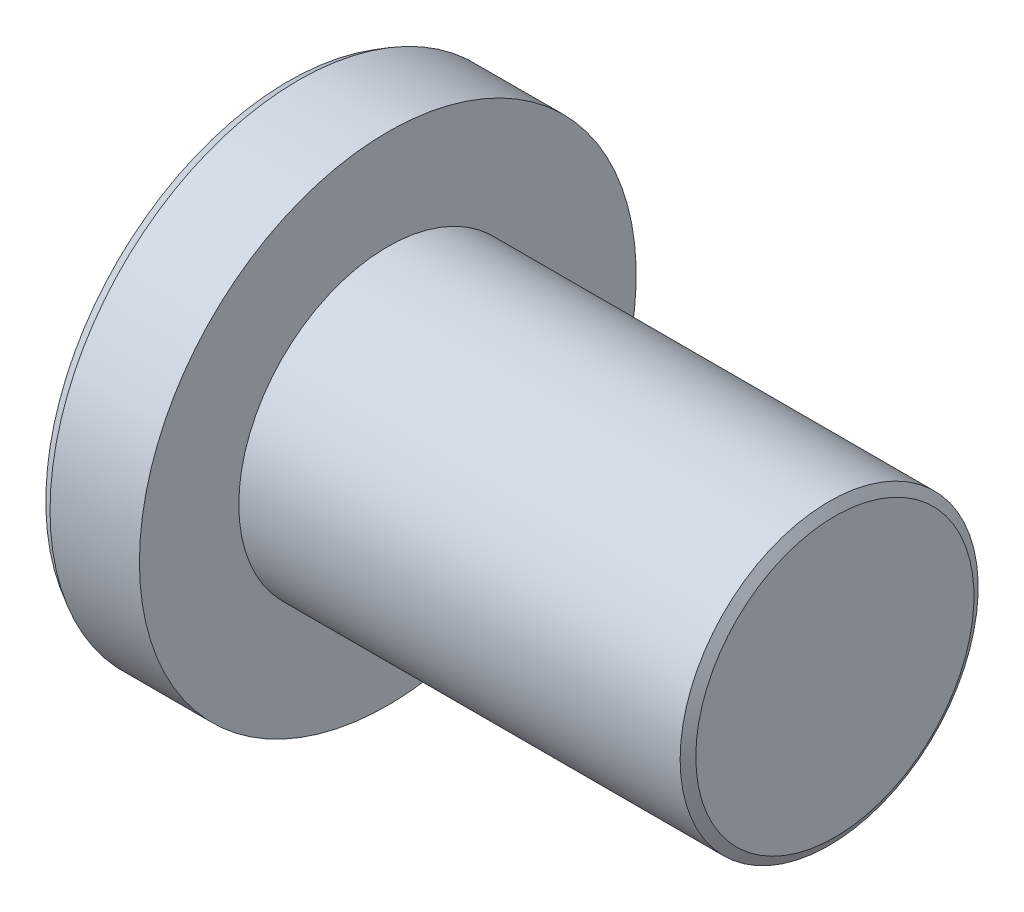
ISO-10303-21;
HEADER;
FILE_DESCRIPTION(('STEP AP214'),'2;1');
FILE_NAME('part.step','',(''),(''),'','','');
FILE_SCHEMA(('AUTOMOTIVE_DESIGN { 1 0 10303 214 1 1 1 1 }'));
ENDSEC;
DATA;
#1=APPLICATION_CONTEXT('core data for automotive mechanical design processes');
#2=APPLICATION_PROTOCOL_DEFINITION('international standard','automotive_design',2000,#1);
#3=PRODUCT_CONTEXT('',#1,'mechanical');
#4=PRODUCT('Part','Part','',(#3));
#5=PRODUCT_RELATED_PRODUCT_CATEGORY('part','',(#4));
#6=PRODUCT_DEFINITION_FORMATION('','',#4);
#7=PRODUCT_DEFINITION_CONTEXT('part definition',#1,'design');
#8=PRODUCT_DEFINITION('design','',#6,#7);
#9=PRODUCT_DEFINITION_SHAPE('','',#8);
#10=(LENGTH_UNIT() NAMED_UNIT(*) SI_UNIT(.MILLI.,.METRE.));
#11=(NAMED_UNIT(*) PLANE_ANGLE_UNIT() SI_UNIT($,.RADIAN.));
#12=(NAMED_UNIT(*) SI_UNIT($,.STERADIAN.) SOLID_ANGLE_UNIT());
#13=UNCERTAINTY_MEASURE_WITH_UNIT(LENGTH_MEASURE(1.E-05),#10,'distance_accuracy_value','');
#14=(GEOMETRIC_REPRESENTATION_CONTEXT(3) GLOBAL_UNCERTAINTY_ASSIGNED_CONTEXT((#13)) GLOBAL_UNIT_ASSIGNED_CONTEXT((#10,
#11,#12)) REPRESENTATION_CONTEXT('',''));
#15=CARTESIAN_POINT('',(0.,0.,0.));
#16=DIRECTION('',(0.,0.,1.));
#17=DIRECTION('',(1.,0.,0.));
#18=AXIS2_PLACEMENT_3D('',#15,#16,#17);
#19=CARTESIAN_POINT('',(55.,15.,0.));
#20=DIRECTION('',(-1.,0.,0.));
#21=DIRECTION('',(0.,0.,1.));
#22=AXIS2_PLACEMENT_3D('',#19,#20,#21);
#23=PLANE('',#22);
#24=CARTESIAN_POINT('',(55.,0.,0.));
#25=DIRECTION('',(-1.,0.,0.));
#26=DIRECTION('',(0.,0.,1.));
#27=AXIS2_PLACEMENT_3D('',#24,#25,#26);
#28=CIRCLE('',#27,14.);
#29=CARTESIAN_POINT('',(55.,0.,14.));
#30=VERTEX_POINT('',#29);
#31=EDGE_CURVE('E39',#30,#30,#28,.F.);
#32=ORIENTED_EDGE('',*,*,#31,.T.);
#33=EDGE_LOOP('',(#32));
#34=FACE_BOUND('',#33,.T.);
#35=ADVANCED_FACE('F29',(#34),#23,.F.);
#36=CARTESIAN_POINT('',(-45.6597764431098,0.,0.));
#37=DIRECTION('',(-1.,0.,0.));
#38=DIRECTION('',(0.,0.,1.));
#39=AXIS2_PLACEMENT_3D('',#36,#37,#38);
#40=CYLINDRICAL_SURFACE('',#39,15.);
#41=CARTESIAN_POINT('',(54.4226497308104,0.,0.));
#42=DIRECTION('',(-1.,0.,0.));
#43=DIRECTION('',(0.,0.,1.));
#44=AXIS2_PLACEMENT_3D('',#41,#42,#43);
#45=CIRCLE('',#44,15.);
#46=CARTESIAN_POINT('',(54.4226497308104,0.,15.));
#47=VERTEX_POINT('',#46);
#48=EDGE_CURVE('E43',#47,#47,#45,.T.);
#49=ORIENTED_EDGE('',*,*,#48,.T.);
#50=EDGE_LOOP('',(#49));
#51=FACE_BOUND('',#50,.T.);
#52=CARTESIAN_POINT('',(10.,0.,0.));
#53=DIRECTION('',(-1.,0.,0.));
#54=DIRECTION('',(0.,0.,1.));
#55=AXIS2_PLACEMENT_3D('',#52,#53,#54);
#56=CIRCLE('',#55,15.);
#57=CARTESIAN_POINT('',(10.,0.,15.));
#58=VERTEX_POINT('',#57);
#59=EDGE_CURVE('E48',#58,#58,#56,.T.);
#60=ORIENTED_EDGE('',*,*,#59,.F.);
#61=EDGE_LOOP('',(#60));
#62=FACE_BOUND('',#61,.T.);
#63=ADVANCED_FACE('F60',(#51,#62),#40,.T.);
#64=CARTESIAN_POINT('',(10.,25.,0.));
#65=DIRECTION('',(-1.,0.,0.));
#66=DIRECTION('',(0.,0.,1.));
#67=AXIS2_PLACEMENT_3D('',#64,#65,#66);
#68=PLANE('',#67);
#69=CARTESIAN_POINT('',(10.,0.,0.));
#70=DIRECTION('',(-1.,0.,0.));
#71=DIRECTION('',(0.,0.,1.));
#72=AXIS2_PLACEMENT_3D('',#69,#70,#71);
#73=CIRCLE('',#72,25.);
#74=CARTESIAN_POINT('',(10.,0.,25.));
#75=VERTEX_POINT('',#74);
#76=EDGE_CURVE('E51',#75,#75,#73,.T.);
#77=ORIENTED_EDGE('',*,*,#76,.F.);
#78=EDGE_LOOP('',(#77));
#79=FACE_BOUND('',#78,.T.);
#80=ORIENTED_EDGE('',*,*,#59,.T.);
#81=EDGE_LOOP('',(#80));
#82=FACE_BOUND('',#81,.T.);
#83=ADVANCED_FACE('F57',(#79,#82),#68,.F.);
#84=CARTESIAN_POINT('',(-45.6597764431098,0.,0.));
#85=DIRECTION('',(-1.,0.,0.));
#86=DIRECTION('',(0.,0.,1.));
#87=AXIS2_PLACEMENT_3D('',#84,#85,#86);
#88=CYLINDRICAL_SURFACE('',#87,25.);
#89=CARTESIAN_POINT('',(0.999999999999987,0.,0.));
#90=DIRECTION('',(1.,0.,0.));
#91=DIRECTION('',(0.,0.,-1.));
#92=AXIS2_PLACEMENT_3D('',#89,#90,#91);
#93=CIRCLE('',#92,25.);
#94=CARTESIAN_POINT('',(0.999999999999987,0.,-25.));
#95=VERTEX_POINT('',#94);
#96=EDGE_CURVE('E10',#95,#95,#93,.T.);
#97=ORIENTED_EDGE('',*,*,#96,.T.);
#98=EDGE_LOOP('',(#97));
#99=FACE_BOUND('',#98,.T.);
#100=ORIENTED_EDGE('',*,*,#76,.T.);
#101=EDGE_LOOP('',(#100));
#102=FACE_BOUND('',#101,.T.);
#103=ADVANCED_FACE('F55',(#99,#102),#88,.T.);
#104=CARTESIAN_POINT('',(0.,0.,0.));
#105=DIRECTION('',(1.,0.,0.));
#106=DIRECTION('',(0.,0.,-1.));
#107=AXIS2_PLACEMENT_3D('',#104,#105,#106);
#108=PLANE('',#107);
#109=CARTESIAN_POINT('',(0.,0.,0.));
#110=DIRECTION('',(1.,0.,0.));
#111=DIRECTION('',(0.,0.,-1.));
#112=AXIS2_PLACEMENT_3D('',#109,#110,#111);
#113=CIRCLE('',#112,24.4226497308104);
#114=CARTESIAN_POINT('',(0.,0.,-24.4226497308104));
#115=VERTEX_POINT('',#114);
#116=EDGE_CURVE('E35',#115,#115,#113,.F.);
#117=ORIENTED_EDGE('',*,*,#116,.T.);
#118=EDGE_LOOP('',(#117));
#119=FACE_BOUND('',#118,.T.);
#120=ADVANCED_FACE('F73',(#119),#108,.F.);
#121=CARTESIAN_POINT('',(54.4226497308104,0.,0.));
#122=DIRECTION('',(-1.,0.,0.));
#123=DIRECTION('',(0.,0.,1.));
#124=AXIS2_PLACEMENT_3D('',#121,#122,#123);
#125=CONICAL_SURFACE('',#124,15.,1.04719755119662);
#126=ORIENTED_EDGE('',*,*,#31,.F.);
#127=EDGE_LOOP('',(#126));
#128=FACE_BOUND('',#127,.T.);
#129=ORIENTED_EDGE('',*,*,#48,.F.);
#130=EDGE_LOOP('',(#129));
#131=FACE_BOUND('',#130,.T.);
#132=ADVANCED_FACE('F76',(#128,#131),#125,.T.);
#133=CARTESIAN_POINT('',(0.,0.,0.));
#134=DIRECTION('',(1.,0.,0.));
#135=DIRECTION('',(0.,0.,-1.));
#136=AXIS2_PLACEMENT_3D('',#133,#134,#135);
#137=CONICAL_SURFACE('',#136,24.4226497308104,0.523598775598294);
#138=ORIENTED_EDGE('',*,*,#96,.F.);
#139=EDGE_LOOP('',(#138));
#140=FACE_BOUND('',#139,.T.);
#141=ORIENTED_EDGE('',*,*,#116,.F.);
#142=EDGE_LOOP('',(#141));
#143=FACE_BOUND('',#142,.T.);
#144=ADVANCED_FACE('F79',(#140,#143),#137,.T.);
#145=CLOSED_SHELL('',(#35,#63,#83,#103,#120,#132,#144));
#146=MANIFOLD_SOLID_BREP('B2',#145);
#147=ADVANCED_BREP_SHAPE_REPRESENTATION('',(#18,#146),#14);
#148=SHAPE_DEFINITION_REPRESENTATION(#9,#147);
ENDSEC;
END-ISO-10303-21;
